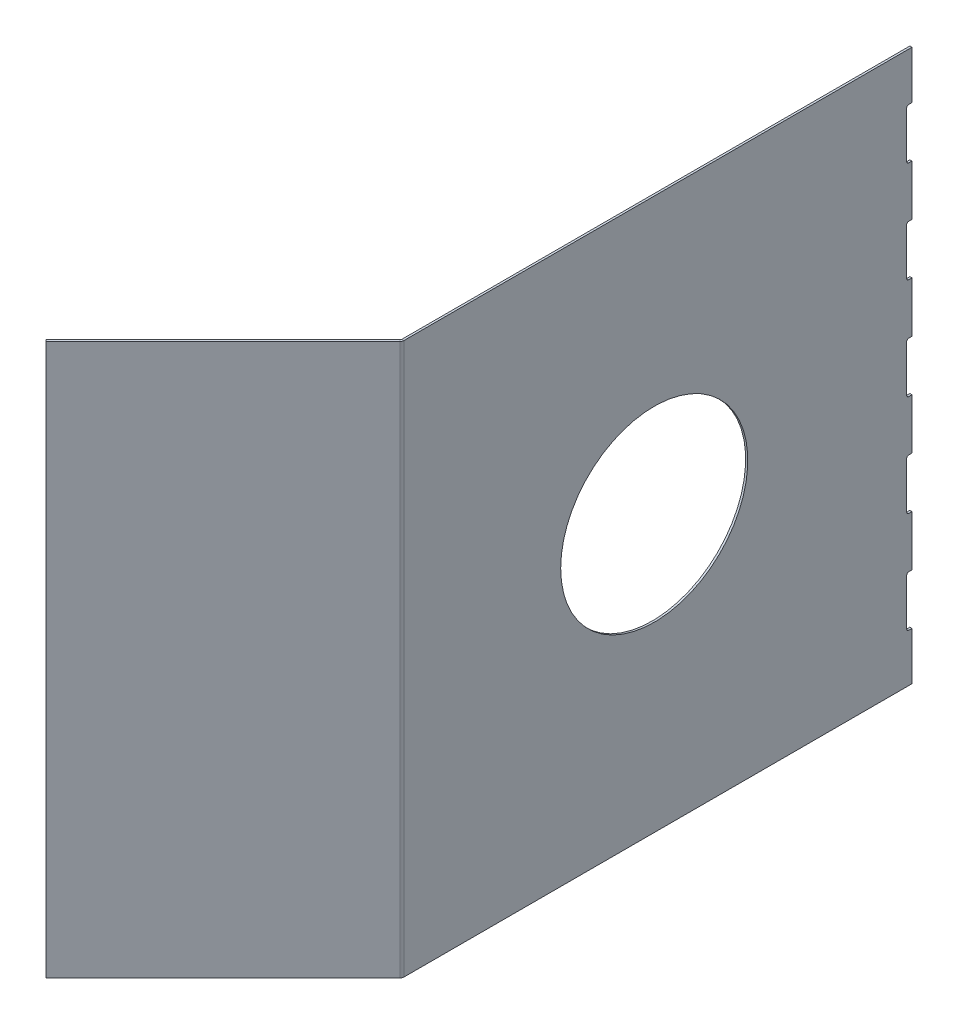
ISO-10303-21;
HEADER;
FILE_DESCRIPTION(('STEP AP214'),'2;1');
FILE_NAME('part.step','',(''),(''),'','','');
FILE_SCHEMA(('AUTOMOTIVE_DESIGN { 1 0 10303 214 1 1 1 1 }'));
ENDSEC;
DATA;
#1=APPLICATION_CONTEXT('core data for automotive mechanical design processes');
#2=APPLICATION_PROTOCOL_DEFINITION('international standard','automotive_design',2000,#1);
#3=PRODUCT_CONTEXT('',#1,'mechanical');
#4=PRODUCT('Part','Part','',(#3));
#5=PRODUCT_RELATED_PRODUCT_CATEGORY('part','',(#4));
#6=PRODUCT_DEFINITION_FORMATION('','',#4);
#7=PRODUCT_DEFINITION_CONTEXT('part definition',#1,'design');
#8=PRODUCT_DEFINITION('design','',#6,#7);
#9=PRODUCT_DEFINITION_SHAPE('','',#8);
#10=(LENGTH_UNIT() NAMED_UNIT(*) SI_UNIT(.MILLI.,.METRE.));
#11=(NAMED_UNIT(*) PLANE_ANGLE_UNIT() SI_UNIT($,.RADIAN.));
#12=(NAMED_UNIT(*) SI_UNIT($,.STERADIAN.) SOLID_ANGLE_UNIT());
#13=UNCERTAINTY_MEASURE_WITH_UNIT(LENGTH_MEASURE(1.E-05),#10,'distance_accuracy_value','');
#14=(GEOMETRIC_REPRESENTATION_CONTEXT(3) GLOBAL_UNCERTAINTY_ASSIGNED_CONTEXT((#13)) GLOBAL_UNIT_ASSIGNED_CONTEXT((#10,
#11,#12)) REPRESENTATION_CONTEXT('',''));
#15=CARTESIAN_POINT('',(0.,0.,0.));
#16=DIRECTION('',(0.,0.,1.));
#17=DIRECTION('',(1.,0.,0.));
#18=AXIS2_PLACEMENT_3D('',#15,#16,#17);
#19=CARTESIAN_POINT('',(-6.35,1660.525,0.));
#20=DIRECTION('',(0.,0.,-1.));
#21=DIRECTION('',(-1.,0.,0.));
#22=AXIS2_PLACEMENT_3D('',#19,#20,#21);
#23=PLANE('',#22);
#24=DIRECTION('',(-1.,0.,0.));
#25=VECTOR('',#24,1.);
#26=CARTESIAN_POINT('',(3.30464822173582E-13,296.8625,0.));
#27=LINE('',#26,#25);
#28=CARTESIAN_POINT('',(3.30464822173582E-13,296.8625,0.));
#29=VERTEX_POINT('',#28);
#30=CARTESIAN_POINT('',(-6.35,296.8625,0.));
#31=VERTEX_POINT('',#30);
#32=EDGE_CURVE('E367',#29,#31,#27,.T.);
#33=ORIENTED_EDGE('',*,*,#32,.T.);
#34=DIRECTION('',(0.,-1.,0.));
#35=VECTOR('',#34,1.);
#36=CARTESIAN_POINT('',(-6.35,1660.525,0.));
#37=LINE('',#36,#35);
#38=CARTESIAN_POINT('',(-6.35,449.2625,0.));
#39=VERTEX_POINT('',#38);
#40=EDGE_CURVE('E564',#39,#31,#37,.T.);
#41=ORIENTED_EDGE('',*,*,#40,.F.);
#42=DIRECTION('',(-1.,0.,0.));
#43=VECTOR('',#42,1.);
#44=CARTESIAN_POINT('',(3.30464822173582E-13,449.2625,0.));
#45=LINE('',#44,#43);
#46=CARTESIAN_POINT('',(3.30464822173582E-13,449.2625,0.));
#47=VERTEX_POINT('',#46);
#48=EDGE_CURVE('E61',#47,#39,#45,.T.);
#49=ORIENTED_EDGE('',*,*,#48,.F.);
#50=DIRECTION('',(0.,-1.,0.));
#51=VECTOR('',#50,1.);
#52=CARTESIAN_POINT('',(0.,1660.525,0.));
#53=LINE('',#52,#51);
#54=EDGE_CURVE('E308',#47,#29,#53,.T.);
#55=ORIENTED_EDGE('',*,*,#54,.T.);
#56=EDGE_LOOP('',(#33,#41,#49,#55));
#57=FACE_BOUND('',#56,.T.);
#58=ADVANCED_FACE('F38',(#57),#23,.T.);
#59=DIRECTION('',(-1.,0.,0.));
#60=VECTOR('',#59,1.);
#61=CARTESIAN_POINT('',(3.30464822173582E-13,601.6625,0.));
#62=LINE('',#61,#60);
#63=CARTESIAN_POINT('',(3.30464822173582E-13,601.6625,0.));
#64=VERTEX_POINT('',#63);
#65=CARTESIAN_POINT('',(-6.35,601.6625,0.));
#66=VERTEX_POINT('',#65);
#67=EDGE_CURVE('E343',#64,#66,#62,.T.);
#68=ORIENTED_EDGE('',*,*,#67,.T.);
#69=CARTESIAN_POINT('',(-6.35,754.0625,0.));
#70=VERTEX_POINT('',#69);
#71=EDGE_CURVE('E568',#70,#66,#37,.T.);
#72=ORIENTED_EDGE('',*,*,#71,.F.);
#73=DIRECTION('',(-1.,0.,0.));
#74=VECTOR('',#73,1.);
#75=CARTESIAN_POINT('',(3.30464822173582E-13,754.0625,0.));
#76=LINE('',#75,#74);
#77=CARTESIAN_POINT('',(3.30464822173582E-13,754.0625,0.));
#78=VERTEX_POINT('',#77);
#79=EDGE_CURVE('E345',#78,#70,#76,.T.);
#80=ORIENTED_EDGE('',*,*,#79,.F.);
#81=EDGE_CURVE('E313',#78,#64,#53,.T.);
#82=ORIENTED_EDGE('',*,*,#81,.T.);
#83=EDGE_LOOP('',(#68,#72,#80,#82));
#84=FACE_BOUND('',#83,.T.);
#85=ADVANCED_FACE('F341',(#84),#23,.T.);
#86=DIRECTION('',(-1.,0.,0.));
#87=VECTOR('',#86,1.);
#88=CARTESIAN_POINT('',(3.30464822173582E-13,906.4625,0.));
#89=LINE('',#88,#87);
#90=CARTESIAN_POINT('',(3.30464822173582E-13,906.4625,0.));
#91=VERTEX_POINT('',#90);
#92=CARTESIAN_POINT('',(-6.35,906.4625,0.));
#93=VERTEX_POINT('',#92);
#94=EDGE_CURVE('E413',#91,#93,#89,.T.);
#95=ORIENTED_EDGE('',*,*,#94,.T.);
#96=CARTESIAN_POINT('',(-6.35,1058.8625,0.));
#97=VERTEX_POINT('',#96);
#98=EDGE_CURVE('E571',#97,#93,#37,.T.);
#99=ORIENTED_EDGE('',*,*,#98,.F.);
#100=DIRECTION('',(-1.,0.,0.));
#101=VECTOR('',#100,1.);
#102=CARTESIAN_POINT('',(3.30464822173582E-13,1058.8625,0.));
#103=LINE('',#102,#101);
#104=CARTESIAN_POINT('',(3.30464822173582E-13,1058.8625,0.));
#105=VERTEX_POINT('',#104);
#106=EDGE_CURVE('E441',#105,#97,#103,.T.);
#107=ORIENTED_EDGE('',*,*,#106,.F.);
#108=EDGE_CURVE('E326',#105,#91,#53,.T.);
#109=ORIENTED_EDGE('',*,*,#108,.T.);
#110=EDGE_LOOP('',(#95,#99,#107,#109));
#111=FACE_BOUND('',#110,.T.);
#112=ADVANCED_FACE('F602',(#111),#23,.T.);
#113=DIRECTION('',(-1.,0.,0.));
#114=VECTOR('',#113,1.);
#115=CARTESIAN_POINT('',(3.30464822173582E-13,1211.2625,0.));
#116=LINE('',#115,#114);
#117=CARTESIAN_POINT('',(3.30464822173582E-13,1211.2625,0.));
#118=VERTEX_POINT('',#117);
#119=CARTESIAN_POINT('',(-6.35,1211.2625,0.));
#120=VERTEX_POINT('',#119);
#121=EDGE_CURVE('E454',#118,#120,#116,.T.);
#122=ORIENTED_EDGE('',*,*,#121,.T.);
#123=CARTESIAN_POINT('',(-6.35,1363.6625,0.));
#124=VERTEX_POINT('',#123);
#125=EDGE_CURVE('E315',#124,#120,#37,.T.);
#126=ORIENTED_EDGE('',*,*,#125,.F.);
#127=DIRECTION('',(-1.,0.,0.));
#128=VECTOR('',#127,1.);
#129=CARTESIAN_POINT('',(3.28730098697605E-13,1363.6625,0.));
#130=LINE('',#129,#128);
#131=CARTESIAN_POINT('',(3.28730098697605E-13,1363.6625,0.));
#132=VERTEX_POINT('',#131);
#133=EDGE_CURVE('E482',#132,#124,#130,.T.);
#134=ORIENTED_EDGE('',*,*,#133,.F.);
#135=EDGE_CURVE('E320',#132,#118,#53,.T.);
#136=ORIENTED_EDGE('',*,*,#135,.T.);
#137=EDGE_LOOP('',(#122,#126,#134,#136));
#138=FACE_BOUND('',#137,.T.);
#139=ADVANCED_FACE('F585',(#138),#23,.T.);
#140=DIRECTION('',(-1.,0.,0.));
#141=VECTOR('',#140,1.);
#142=CARTESIAN_POINT('',(3.28730098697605E-13,1516.0625,0.));
#143=LINE('',#142,#141);
#144=CARTESIAN_POINT('',(3.28730098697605E-13,1516.0625,0.));
#145=VERTEX_POINT('',#144);
#146=CARTESIAN_POINT('',(-6.35,1516.0625,0.));
#147=VERTEX_POINT('',#146);
#148=EDGE_CURVE('E495',#145,#147,#143,.T.);
#149=ORIENTED_EDGE('',*,*,#148,.T.);
#150=CARTESIAN_POINT('',(-6.35,1660.525,0.));
#151=VERTEX_POINT('',#150);
#152=EDGE_CURVE('E309',#151,#147,#37,.T.);
#153=ORIENTED_EDGE('',*,*,#152,.F.);
#154=DIRECTION('',(1.,0.,0.));
#155=VECTOR('',#154,1.);
#156=CARTESIAN_POINT('',(-6.35,1660.525,0.));
#157=LINE('',#156,#155);
#158=CARTESIAN_POINT('',(0.,1660.525,0.));
#159=VERTEX_POINT('',#158);
#160=EDGE_CURVE('E528',#151,#159,#157,.T.);
#161=ORIENTED_EDGE('',*,*,#160,.T.);
#162=EDGE_CURVE('E311',#159,#145,#53,.T.);
#163=ORIENTED_EDGE('',*,*,#162,.T.);
#164=EDGE_LOOP('',(#149,#153,#161,#163));
#165=FACE_BOUND('',#164,.T.);
#166=ADVANCED_FACE('F641',(#165),#23,.T.);
#167=CARTESIAN_POINT('',(-3.71974387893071,1660.525,1538.83224387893));
#168=DIRECTION('',(0.,1.,0.));
#169=DIRECTION('',(0.,0.,1.));
#170=AXIS2_PLACEMENT_3D('',#167,#168,#169);
#171=PLANE('',#170);
#172=DIRECTION('',(-0.707106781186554,0.,-0.707106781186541));
#173=VECTOR('',#172,1.);
#174=CARTESIAN_POINT('',(-3.71974387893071,1660.525,1538.83224387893));
#175=LINE('',#174,#173);
#176=CARTESIAN_POINT('',(-3.71974387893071,1660.525,1538.83224387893));
#177=VERTEX_POINT('',#176);
#178=CARTESIAN_POINT('',(-8.2098719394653,1660.525,1534.3421158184));
#179=VERTEX_POINT('',#178);
#180=EDGE_CURVE('E11',#177,#179,#175,.T.);
#181=ORIENTED_EDGE('',*,*,#180,.F.);
#182=CARTESIAN_POINT('',(-12.6999999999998,1660.525,1529.85198775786));
#183=DIRECTION('',(0.,1.,0.));
#184=DIRECTION('',(0.,0.,1.));
#185=AXIS2_PLACEMENT_3D('',#182,#183,#184);
#186=CIRCLE('',#185,12.7);
#187=CARTESIAN_POINT('',(1.87352833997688E-13,1660.525,1529.85198775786));
#188=VERTEX_POINT('',#187);
#189=EDGE_CURVE('E522',#188,#177,#186,.F.);
#190=ORIENTED_EDGE('',*,*,#189,.F.);
#191=DIRECTION('',(1.,0.,0.));
#192=VECTOR('',#191,1.);
#193=CARTESIAN_POINT('',(-6.3499999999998,1660.525,1529.85198775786));
#194=LINE('',#193,#192);
#195=CARTESIAN_POINT('',(-6.3499999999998,1660.525,1529.85198775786));
#196=VERTEX_POINT('',#195);
#197=EDGE_CURVE('E46',#196,#188,#194,.T.);
#198=ORIENTED_EDGE('',*,*,#197,.F.);
#199=CARTESIAN_POINT('',(-12.6999999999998,1660.525,1529.85198775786));
#200=DIRECTION('',(0.,1.,0.));
#201=DIRECTION('',(1.,0.,0.));
#202=AXIS2_PLACEMENT_3D('',#199,#200,#201);
#203=CIRCLE('',#202,6.35);
#204=EDGE_CURVE('E533',#196,#179,#203,.F.);
#205=ORIENTED_EDGE('',*,*,#204,.T.);
#206=EDGE_LOOP('',(#181,#190,#198,#205));
#207=FACE_BOUND('',#206,.T.);
#208=ADVANCED_FACE('F40',(#207),#171,.T.);
#209=CARTESIAN_POINT('',(-6.3499999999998,1660.525,1529.85198775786));
#210=DIRECTION('',(0.,1.,0.));
#211=DIRECTION('',(0.,0.,1.));
#212=AXIS2_PLACEMENT_3D('',#209,#210,#211);
#213=PLANE('',#212);
#214=DIRECTION('',(-0.707106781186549,0.,0.707106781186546));
#215=VECTOR('',#214,1.);
#216=CARTESIAN_POINT('',(1.87997060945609E-13,1660.525,1535.1125));
#217=LINE('',#216,#215);
#218=CARTESIAN_POINT('',(-536.570303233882,1660.525,2071.68280323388));
#219=VERTEX_POINT('',#218);
#220=EDGE_CURVE('E519',#177,#219,#217,.T.);
#221=ORIENTED_EDGE('',*,*,#220,.F.);
#222=ORIENTED_EDGE('',*,*,#180,.T.);
#223=DIRECTION('',(-0.707106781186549,0.,0.707106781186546));
#224=VECTOR('',#223,1.);
#225=CARTESIAN_POINT('',(-4.49012806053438,1660.525,1530.62237193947));
#226=LINE('',#225,#224);
#227=CARTESIAN_POINT('',(-541.060431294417,1660.525,2067.19267517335));
#228=VERTEX_POINT('',#227);
#229=EDGE_CURVE('E513',#179,#228,#226,.T.);
#230=ORIENTED_EDGE('',*,*,#229,.T.);
#231=DIRECTION('',(-0.707106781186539,0.,-0.707106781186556));
#232=VECTOR('',#231,1.);
#233=CARTESIAN_POINT('',(-536.570303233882,1660.525,2071.68280323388));
#234=LINE('',#233,#232);
#235=EDGE_CURVE('E515',#219,#228,#234,.T.);
#236=ORIENTED_EDGE('',*,*,#235,.F.);
#237=EDGE_LOOP('',(#221,#222,#230,#236));
#238=FACE_BOUND('',#237,.T.);
#239=ADVANCED_FACE('F654',(#238),#213,.T.);
#240=CARTESIAN_POINT('',(1.87352833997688E-13,0.,1529.85198775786));
#241=DIRECTION('',(0.,-1.,0.));
#242=DIRECTION('',(0.,0.,-1.));
#243=AXIS2_PLACEMENT_3D('',#240,#241,#242);
#244=PLANE('',#243);
#245=DIRECTION('',(-1.,0.,0.));
#246=VECTOR('',#245,1.);
#247=CARTESIAN_POINT('',(1.87352833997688E-13,0.,1529.85198775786));
#248=LINE('',#247,#246);
#249=CARTESIAN_POINT('',(1.87352833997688E-13,0.,1529.85198775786));
#250=VERTEX_POINT('',#249);
#251=CARTESIAN_POINT('',(-6.3499999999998,0.,1529.85198775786));
#252=VERTEX_POINT('',#251);
#253=EDGE_CURVE('E719',#250,#252,#248,.T.);
#254=ORIENTED_EDGE('',*,*,#253,.F.);
#255=CARTESIAN_POINT('',(-12.6999999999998,0.,1529.85198775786));
#256=DIRECTION('',(0.,1.,0.));
#257=DIRECTION('',(0.,0.,1.));
#258=AXIS2_PLACEMENT_3D('',#255,#256,#257);
#259=CIRCLE('',#258,12.7);
#260=CARTESIAN_POINT('',(-3.71974387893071,0.,1538.83224387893));
#261=VERTEX_POINT('',#260);
#262=EDGE_CURVE('E545',#250,#261,#259,.F.);
#263=ORIENTED_EDGE('',*,*,#262,.T.);
#264=DIRECTION('',(0.707106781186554,0.,0.707106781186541));
#265=VECTOR('',#264,1.);
#266=CARTESIAN_POINT('',(-8.2098719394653,0.,1534.3421158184));
#267=LINE('',#266,#265);
#268=CARTESIAN_POINT('',(-8.2098719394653,0.,1534.3421158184));
#269=VERTEX_POINT('',#268);
#270=EDGE_CURVE('E709',#269,#261,#267,.T.);
#271=ORIENTED_EDGE('',*,*,#270,.F.);
#272=CARTESIAN_POINT('',(-12.6999999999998,0.,1529.85198775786));
#273=DIRECTION('',(0.,1.,0.));
#274=DIRECTION('',(1.,0.,0.));
#275=AXIS2_PLACEMENT_3D('',#272,#273,#274);
#276=CIRCLE('',#275,6.35);
#277=EDGE_CURVE('E516',#252,#269,#276,.F.);
#278=ORIENTED_EDGE('',*,*,#277,.F.);
#279=EDGE_LOOP('',(#254,#263,#271,#278));
#280=FACE_BOUND('',#279,.T.);
#281=ADVANCED_FACE('F726',(#280),#244,.T.);
#282=CARTESIAN_POINT('',(-8.2098719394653,0.,1534.3421158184));
#283=DIRECTION('',(0.,-1.,0.));
#284=DIRECTION('',(0.,0.,-1.));
#285=AXIS2_PLACEMENT_3D('',#282,#283,#284);
#286=PLANE('',#285);
#287=DIRECTION('',(0.,0.,1.));
#288=VECTOR('',#287,1.);
#289=CARTESIAN_POINT('',(0.,0.,0.));
#290=LINE('',#289,#288);
#291=CARTESIAN_POINT('',(0.,0.,0.));
#292=VERTEX_POINT('',#291);
#293=EDGE_CURVE('E306',#292,#250,#290,.T.);
#294=ORIENTED_EDGE('',*,*,#293,.T.);
#295=ORIENTED_EDGE('',*,*,#253,.T.);
#296=DIRECTION('',(0.,0.,1.));
#297=VECTOR('',#296,1.);
#298=CARTESIAN_POINT('',(-6.35,0.,0.));
#299=LINE('',#298,#297);
#300=CARTESIAN_POINT('',(-6.35,0.,0.));
#301=VERTEX_POINT('',#300);
#302=EDGE_CURVE('E551',#301,#252,#299,.T.);
#303=ORIENTED_EDGE('',*,*,#302,.F.);
#304=DIRECTION('',(1.,0.,0.));
#305=VECTOR('',#304,1.);
#306=CARTESIAN_POINT('',(-6.35,0.,0.));
#307=LINE('',#306,#305);
#308=EDGE_CURVE('E549',#301,#292,#307,.T.);
#309=ORIENTED_EDGE('',*,*,#308,.T.);
#310=EDGE_LOOP('',(#294,#295,#303,#309));
#311=FACE_BOUND('',#310,.T.);
#312=ADVANCED_FACE('F725',(#311),#286,.T.);
#313=CARTESIAN_POINT('',(-4.49012806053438,1660.525,1530.62237193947));
#314=DIRECTION('',(0.707106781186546,0.,0.707106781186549));
#315=DIRECTION('',(0.707106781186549,0.,-0.707106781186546));
#316=AXIS2_PLACEMENT_3D('',#313,#314,#315);
#317=PLANE('',#316);
#318=DIRECTION('',(-0.707106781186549,0.,0.707106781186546));
#319=VECTOR('',#318,1.);
#320=CARTESIAN_POINT('',(-4.49012806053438,0.,1530.62237193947));
#321=LINE('',#320,#319);
#322=CARTESIAN_POINT('',(-541.060431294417,0.,2067.19267517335));
#323=VERTEX_POINT('',#322);
#324=EDGE_CURVE('E510',#269,#323,#321,.T.);
#325=ORIENTED_EDGE('',*,*,#324,.T.);
#326=DIRECTION('',(0.,-1.,0.));
#327=VECTOR('',#326,1.);
#328=CARTESIAN_POINT('',(-541.060431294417,1660.525,2067.19267517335));
#329=LINE('',#328,#327);
#330=EDGE_CURVE('E717',#228,#323,#329,.T.);
#331=ORIENTED_EDGE('',*,*,#330,.F.);
#332=ORIENTED_EDGE('',*,*,#229,.F.);
#333=DIRECTION('',(0.,-1.,0.));
#334=VECTOR('',#333,1.);
#335=CARTESIAN_POINT('',(-8.2098719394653,1660.525,1534.3421158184));
#336=LINE('',#335,#334);
#337=EDGE_CURVE('E536',#179,#269,#336,.T.);
#338=ORIENTED_EDGE('',*,*,#337,.T.);
#339=EDGE_LOOP('',(#325,#331,#332,#338));
#340=FACE_BOUND('',#339,.T.);
#341=ADVANCED_FACE('F707',(#340),#317,.F.);
#342=CARTESIAN_POINT('',(-536.570303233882,1660.525,2071.68280323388));
#343=DIRECTION('',(-0.707106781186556,0.,0.707106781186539));
#344=DIRECTION('',(0.707106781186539,0.,0.707106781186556));
#345=AXIS2_PLACEMENT_3D('',#342,#343,#344);
#346=PLANE('',#345);
#347=DIRECTION('',(-0.707106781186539,0.,-0.707106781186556));
#348=VECTOR('',#347,1.);
#349=CARTESIAN_POINT('',(-536.570303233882,0.,2071.68280323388));
#350=LINE('',#349,#348);
#351=CARTESIAN_POINT('',(-536.570303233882,0.,2071.68280323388));
#352=VERTEX_POINT('',#351);
#353=EDGE_CURVE('E539',#352,#323,#350,.T.);
#354=ORIENTED_EDGE('',*,*,#353,.F.);
#355=DIRECTION('',(0.,-1.,0.));
#356=VECTOR('',#355,1.);
#357=CARTESIAN_POINT('',(-536.570303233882,1660.525,2071.68280323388));
#358=LINE('',#357,#356);
#359=EDGE_CURVE('E715',#219,#352,#358,.T.);
#360=ORIENTED_EDGE('',*,*,#359,.F.);
#361=ORIENTED_EDGE('',*,*,#235,.T.);
#362=ORIENTED_EDGE('',*,*,#330,.T.);
#363=EDGE_LOOP('',(#354,#360,#361,#362));
#364=FACE_BOUND('',#363,.T.);
#365=ADVANCED_FACE('F714',(#364),#346,.T.);
#366=CARTESIAN_POINT('',(1.87997060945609E-13,1660.525,1535.1125));
#367=DIRECTION('',(0.707106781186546,0.,0.707106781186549));
#368=DIRECTION('',(0.707106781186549,0.,-0.707106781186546));
#369=AXIS2_PLACEMENT_3D('',#366,#367,#368);
#370=PLANE('',#369);
#371=DIRECTION('',(-0.707106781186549,0.,0.707106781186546));
#372=VECTOR('',#371,1.);
#373=CARTESIAN_POINT('',(1.87997060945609E-13,0.,1535.1125));
#374=LINE('',#373,#372);
#375=EDGE_CURVE('E542',#261,#352,#374,.T.);
#376=ORIENTED_EDGE('',*,*,#375,.F.);
#377=DIRECTION('',(0.,-1.,0.));
#378=VECTOR('',#377,1.);
#379=CARTESIAN_POINT('',(-3.71974387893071,1660.525,1538.83224387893));
#380=LINE('',#379,#378);
#381=EDGE_CURVE('E324',#177,#261,#380,.T.);
#382=ORIENTED_EDGE('',*,*,#381,.F.);
#383=ORIENTED_EDGE('',*,*,#220,.T.);
#384=ORIENTED_EDGE('',*,*,#359,.T.);
#385=EDGE_LOOP('',(#376,#382,#383,#384));
#386=FACE_BOUND('',#385,.T.);
#387=ADVANCED_FACE('F732',(#386),#370,.T.);
#388=CARTESIAN_POINT('',(-12.6999999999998,1660.525,1529.85198775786));
#389=DIRECTION('',(0.,-1.,0.));
#390=DIRECTION('',(0.,0.,-1.));
#391=AXIS2_PLACEMENT_3D('',#388,#389,#390);
#392=CYLINDRICAL_SURFACE('',#391,12.7);
#393=ORIENTED_EDGE('',*,*,#262,.F.);
#394=DIRECTION('',(0.,-1.,0.));
#395=VECTOR('',#394,1.);
#396=CARTESIAN_POINT('',(1.87352833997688E-13,1660.525,1529.85198775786));
#397=LINE('',#396,#395);
#398=EDGE_CURVE('E319',#188,#250,#397,.T.);
#399=ORIENTED_EDGE('',*,*,#398,.F.);
#400=ORIENTED_EDGE('',*,*,#189,.T.);
#401=ORIENTED_EDGE('',*,*,#381,.T.);
#402=EDGE_LOOP('',(#393,#399,#400,#401));
#403=FACE_BOUND('',#402,.T.);
#404=ADVANCED_FACE('F648',(#403),#392,.T.);
#405=CARTESIAN_POINT('',(0.,1660.525,0.));
#406=DIRECTION('',(1.,0.,0.));
#407=DIRECTION('',(0.,0.,-1.));
#408=AXIS2_PLACEMENT_3D('',#405,#406,#407);
#409=PLANE('',#408);
#410=DIRECTION('',(0.,0.,-1.));
#411=VECTOR('',#410,1.);
#412=CARTESIAN_POINT('',(3.30464822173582E-13,296.8625,0.));
#413=LINE('',#412,#411);
#414=CARTESIAN_POINT('',(3.3133218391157E-13,296.8625,9.52500000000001));
#415=VERTEX_POINT('',#414);
#416=EDGE_CURVE('E299',#415,#29,#413,.T.);
#417=ORIENTED_EDGE('',*,*,#416,.T.);
#418=ORIENTED_EDGE('',*,*,#54,.F.);
#419=DIRECTION('',(0.,0.,1.));
#420=VECTOR('',#419,1.);
#421=CARTESIAN_POINT('',(3.30464822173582E-13,449.2625,0.));
#422=LINE('',#421,#420);
#423=CARTESIAN_POINT('',(3.3133218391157E-13,449.2625,9.52500000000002));
#424=VERTEX_POINT('',#423);
#425=EDGE_CURVE('E378',#47,#424,#422,.T.);
#426=ORIENTED_EDGE('',*,*,#425,.T.);
#427=CARTESIAN_POINT('',(3.3133218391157E-13,455.6125,9.52500000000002));
#428=DIRECTION('',(-1.,0.,0.));
#429=DIRECTION('',(0.,0.,1.));
#430=AXIS2_PLACEMENT_3D('',#427,#428,#429);
#431=CIRCLE('',#430,6.35000000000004);
#432=CARTESIAN_POINT('',(3.32199545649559E-13,455.6125,15.875));
#433=VERTEX_POINT('',#432);
#434=EDGE_CURVE('E1205',#424,#433,#431,.T.);
#435=ORIENTED_EDGE('',*,*,#434,.T.);
#436=DIRECTION('',(0.,1.,0.));
#437=VECTOR('',#436,1.);
#438=CARTESIAN_POINT('',(3.32199545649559E-13,595.3125,15.875));
#439=LINE('',#438,#437);
#440=CARTESIAN_POINT('',(3.32199545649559E-13,595.3125,15.875));
#441=VERTEX_POINT('',#440);
#442=EDGE_CURVE('E360',#433,#441,#439,.T.);
#443=ORIENTED_EDGE('',*,*,#442,.T.);
#444=CARTESIAN_POINT('',(3.3133218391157E-13,595.3125,9.52500000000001));
#445=DIRECTION('',(-1.,0.,0.));
#446=DIRECTION('',(0.,0.,1.));
#447=AXIS2_PLACEMENT_3D('',#444,#445,#446);
#448=CIRCLE('',#447,6.35000000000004);
#449=CARTESIAN_POINT('',(3.3133218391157E-13,601.6625,9.52500000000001));
#450=VERTEX_POINT('',#449);
#451=EDGE_CURVE('E355',#441,#450,#448,.T.);
#452=ORIENTED_EDGE('',*,*,#451,.T.);
#453=DIRECTION('',(0.,0.,-1.));
#454=VECTOR('',#453,1.);
#455=CARTESIAN_POINT('',(3.30464822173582E-13,601.6625,0.));
#456=LINE('',#455,#454);
#457=EDGE_CURVE('E352',#450,#64,#456,.T.);
#458=ORIENTED_EDGE('',*,*,#457,.T.);
#459=ORIENTED_EDGE('',*,*,#81,.F.);
#460=DIRECTION('',(0.,0.,1.));
#461=VECTOR('',#460,1.);
#462=CARTESIAN_POINT('',(3.30464822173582E-13,754.0625,0.));
#463=LINE('',#462,#461);
#464=CARTESIAN_POINT('',(3.3133218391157E-13,754.0625,9.52500000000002));
#465=VERTEX_POINT('',#464);
#466=EDGE_CURVE('E349',#78,#465,#463,.T.);
#467=ORIENTED_EDGE('',*,*,#466,.T.);
#468=CARTESIAN_POINT('',(3.3133218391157E-13,760.4125,9.52500000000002));
#469=DIRECTION('',(-1.,0.,0.));
#470=DIRECTION('',(0.,0.,1.));
#471=AXIS2_PLACEMENT_3D('',#468,#469,#470);
#472=CIRCLE('',#471,6.35000000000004);
#473=CARTESIAN_POINT('',(3.32199545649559E-13,760.4125,15.875));
#474=VERTEX_POINT('',#473);
#475=EDGE_CURVE('E389',#465,#474,#472,.T.);
#476=ORIENTED_EDGE('',*,*,#475,.T.);
#477=DIRECTION('',(0.,1.,0.));
#478=VECTOR('',#477,1.);
#479=CARTESIAN_POINT('',(3.32199545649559E-13,900.1125,15.875));
#480=LINE('',#479,#478);
#481=CARTESIAN_POINT('',(3.32199545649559E-13,900.1125,15.875));
#482=VERTEX_POINT('',#481);
#483=EDGE_CURVE('E392',#474,#482,#480,.T.);
#484=ORIENTED_EDGE('',*,*,#483,.T.);
#485=CARTESIAN_POINT('',(3.3133218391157E-13,900.1125,9.52500000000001));
#486=DIRECTION('',(-1.,0.,0.));
#487=DIRECTION('',(0.,0.,1.));
#488=AXIS2_PLACEMENT_3D('',#485,#486,#487);
#489=CIRCLE('',#488,6.35000000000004);
#490=CARTESIAN_POINT('',(3.3133218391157E-13,906.4625,9.52500000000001));
#491=VERTEX_POINT('',#490);
#492=EDGE_CURVE('E395',#482,#491,#489,.T.);
#493=ORIENTED_EDGE('',*,*,#492,.T.);
#494=DIRECTION('',(0.,0.,-1.));
#495=VECTOR('',#494,1.);
#496=CARTESIAN_POINT('',(3.30464822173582E-13,906.4625,0.));
#497=LINE('',#496,#495);
#498=EDGE_CURVE('E398',#491,#91,#497,.T.);
#499=ORIENTED_EDGE('',*,*,#498,.T.);
#500=ORIENTED_EDGE('',*,*,#108,.F.);
#501=DIRECTION('',(0.,0.,1.));
#502=VECTOR('',#501,1.);
#503=CARTESIAN_POINT('',(3.30464822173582E-13,1058.8625,0.));
#504=LINE('',#503,#502);
#505=CARTESIAN_POINT('',(3.3133218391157E-13,1058.8625,9.52500000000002));
#506=VERTEX_POINT('',#505);
#507=EDGE_CURVE('E425',#105,#506,#504,.T.);
#508=ORIENTED_EDGE('',*,*,#507,.T.);
#509=CARTESIAN_POINT('',(3.3133218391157E-13,1065.2125,9.52500000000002));
#510=DIRECTION('',(-1.,0.,0.));
#511=DIRECTION('',(0.,0.,1.));
#512=AXIS2_PLACEMENT_3D('',#509,#510,#511);
#513=CIRCLE('',#512,6.35000000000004);
#514=CARTESIAN_POINT('',(3.32199545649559E-13,1065.2125,15.875));
#515=VERTEX_POINT('',#514);
#516=EDGE_CURVE('E428',#506,#515,#513,.T.);
#517=ORIENTED_EDGE('',*,*,#516,.T.);
#518=DIRECTION('',(0.,1.,0.));
#519=VECTOR('',#518,1.);
#520=CARTESIAN_POINT('',(3.32199545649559E-13,1204.9125,15.875));
#521=LINE('',#520,#519);
#522=CARTESIAN_POINT('',(3.32199545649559E-13,1204.9125,15.875));
#523=VERTEX_POINT('',#522);
#524=EDGE_CURVE('E432',#515,#523,#521,.T.);
#525=ORIENTED_EDGE('',*,*,#524,.T.);
#526=CARTESIAN_POINT('',(3.3133218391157E-13,1204.9125,9.52500000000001));
#527=DIRECTION('',(-1.,0.,0.));
#528=DIRECTION('',(0.,0.,1.));
#529=AXIS2_PLACEMENT_3D('',#526,#527,#528);
#530=CIRCLE('',#529,6.35000000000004);
#531=CARTESIAN_POINT('',(3.3133218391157E-13,1211.2625,9.52500000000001));
#532=VERTEX_POINT('',#531);
#533=EDGE_CURVE('E435',#523,#532,#530,.T.);
#534=ORIENTED_EDGE('',*,*,#533,.T.);
#535=DIRECTION('',(0.,0.,-1.));
#536=VECTOR('',#535,1.);
#537=CARTESIAN_POINT('',(3.30464822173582E-13,1211.2625,0.));
#538=LINE('',#537,#536);
#539=EDGE_CURVE('E438',#532,#118,#538,.T.);
#540=ORIENTED_EDGE('',*,*,#539,.T.);
#541=ORIENTED_EDGE('',*,*,#135,.F.);
#542=DIRECTION('',(0.,0.,1.));
#543=VECTOR('',#542,1.);
#544=CARTESIAN_POINT('',(3.28730098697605E-13,1363.6625,0.));
#545=LINE('',#544,#543);
#546=CARTESIAN_POINT('',(3.29597460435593E-13,1363.6625,9.52500000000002));
#547=VERTEX_POINT('',#546);
#548=EDGE_CURVE('E466',#132,#547,#545,.T.);
#549=ORIENTED_EDGE('',*,*,#548,.T.);
#550=CARTESIAN_POINT('',(3.29597460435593E-13,1370.0125,9.52500000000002));
#551=DIRECTION('',(-1.,0.,0.));
#552=DIRECTION('',(0.,0.,1.));
#553=AXIS2_PLACEMENT_3D('',#550,#551,#552);
#554=CIRCLE('',#553,6.35000000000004);
#555=CARTESIAN_POINT('',(3.30464822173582E-13,1370.0125,15.875));
#556=VERTEX_POINT('',#555);
#557=EDGE_CURVE('E469',#547,#556,#554,.T.);
#558=ORIENTED_EDGE('',*,*,#557,.T.);
#559=DIRECTION('',(0.,1.,0.));
#560=VECTOR('',#559,1.);
#561=CARTESIAN_POINT('',(3.30464822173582E-13,1509.7125,15.875));
#562=LINE('',#561,#560);
#563=CARTESIAN_POINT('',(3.30464822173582E-13,1509.7125,15.875));
#564=VERTEX_POINT('',#563);
#565=EDGE_CURVE('E473',#556,#564,#562,.T.);
#566=ORIENTED_EDGE('',*,*,#565,.T.);
#567=CARTESIAN_POINT('',(3.29597460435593E-13,1509.7125,9.52500000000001));
#568=DIRECTION('',(-1.,0.,0.));
#569=DIRECTION('',(0.,0.,1.));
#570=AXIS2_PLACEMENT_3D('',#567,#568,#569);
#571=CIRCLE('',#570,6.35000000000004);
#572=CARTESIAN_POINT('',(3.29597460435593E-13,1516.0625,9.52500000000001));
#573=VERTEX_POINT('',#572);
#574=EDGE_CURVE('E476',#564,#573,#571,.T.);
#575=ORIENTED_EDGE('',*,*,#574,.T.);
#576=DIRECTION('',(0.,0.,-1.));
#577=VECTOR('',#576,1.);
#578=CARTESIAN_POINT('',(3.28730098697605E-13,1516.0625,0.));
#579=LINE('',#578,#577);
#580=EDGE_CURVE('E479',#573,#145,#579,.T.);
#581=ORIENTED_EDGE('',*,*,#580,.T.);
#582=ORIENTED_EDGE('',*,*,#162,.F.);
#583=DIRECTION('',(0.,0.,1.));
#584=VECTOR('',#583,1.);
#585=CARTESIAN_POINT('',(0.,1660.525,0.));
#586=LINE('',#585,#584);
#587=EDGE_CURVE('E525',#159,#188,#586,.T.);
#588=ORIENTED_EDGE('',*,*,#587,.T.);
#589=ORIENTED_EDGE('',*,*,#398,.T.);
#590=ORIENTED_EDGE('',*,*,#293,.F.);
#591=CARTESIAN_POINT('',(3.30464822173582E-13,144.4625,0.));
#592=VERTEX_POINT('',#591);
#593=EDGE_CURVE('E296',#592,#292,#53,.T.);
#594=ORIENTED_EDGE('',*,*,#593,.F.);
#595=DIRECTION('',(0.,0.,1.));
#596=VECTOR('',#595,1.);
#597=CARTESIAN_POINT('',(3.30464822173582E-13,144.4625,0.));
#598=LINE('',#597,#596);
#599=CARTESIAN_POINT('',(3.3133218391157E-13,144.4625,9.52500000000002));
#600=VERTEX_POINT('',#599);
#601=EDGE_CURVE('E282',#592,#600,#598,.T.);
#602=ORIENTED_EDGE('',*,*,#601,.T.);
#603=CARTESIAN_POINT('',(3.3133218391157E-13,150.8125,9.52500000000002));
#604=DIRECTION('',(-1.,0.,0.));
#605=DIRECTION('',(0.,0.,1.));
#606=AXIS2_PLACEMENT_3D('',#603,#604,#605);
#607=CIRCLE('',#606,6.35000000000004);
#608=CARTESIAN_POINT('',(3.32199545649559E-13,150.8125,15.875));
#609=VERTEX_POINT('',#608);
#610=EDGE_CURVE('E289',#600,#609,#607,.T.);
#611=ORIENTED_EDGE('',*,*,#610,.T.);
#612=DIRECTION('',(0.,1.,0.));
#613=VECTOR('',#612,1.);
#614=CARTESIAN_POINT('',(3.32199545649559E-13,290.5125,15.875));
#615=LINE('',#614,#613);
#616=CARTESIAN_POINT('',(3.32199545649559E-13,290.5125,15.875));
#617=VERTEX_POINT('',#616);
#618=EDGE_CURVE('E1219',#609,#617,#615,.T.);
#619=ORIENTED_EDGE('',*,*,#618,.T.);
#620=CARTESIAN_POINT('',(3.3133218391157E-13,290.5125,9.52500000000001));
#621=DIRECTION('',(-1.,0.,0.));
#622=DIRECTION('',(0.,0.,1.));
#623=AXIS2_PLACEMENT_3D('',#620,#621,#622);
#624=CIRCLE('',#623,6.35000000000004);
#625=EDGE_CURVE('E1217',#617,#415,#624,.T.);
#626=ORIENTED_EDGE('',*,*,#625,.T.);
#627=EDGE_LOOP('',(#417,#418,#426,#435,#443,#452,#458,#459,#467,#476,#484,#493,#499,#500,#508,
#517,#525,#534,#540,#541,#549,#558,#566,#575,#581,#582,#588,#589,#590,#594,#602,#611,#619,#626));
#628=FACE_BOUND('',#627,.T.);
#629=CARTESIAN_POINT('',(2.94035629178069E-13,830.2625,776.2875));
#630=DIRECTION('',(-1.,0.,0.));
#631=DIRECTION('',(0.,0.,1.));
#632=AXIS2_PLACEMENT_3D('',#629,#630,#631);
#633=CIRCLE('',#632,281.78125);
#634=CARTESIAN_POINT('',(3.28543879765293E-13,830.2625,1058.06875));
#635=VERTEX_POINT('',#634);
#636=EDGE_CURVE('E507',#635,#635,#633,.T.);
#637=ORIENTED_EDGE('',*,*,#636,.T.);
#638=EDGE_LOOP('',(#637));
#639=FACE_BOUND('',#638,.T.);
#640=ADVANCED_FACE('F302',(#628,#639),#409,.T.);
#641=DIRECTION('',(-1.,0.,0.));
#642=VECTOR('',#641,1.);
#643=CARTESIAN_POINT('',(3.30464822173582E-13,144.4625,0.));
#644=LINE('',#643,#642);
#645=CARTESIAN_POINT('',(-6.35,144.4625,0.));
#646=VERTEX_POINT('',#645);
#647=EDGE_CURVE('E53',#592,#646,#644,.T.);
#648=ORIENTED_EDGE('',*,*,#647,.F.);
#649=ORIENTED_EDGE('',*,*,#593,.T.);
#650=ORIENTED_EDGE('',*,*,#308,.F.);
#651=EDGE_CURVE('E298',#646,#301,#37,.T.);
#652=ORIENTED_EDGE('',*,*,#651,.F.);
#653=EDGE_LOOP('',(#648,#649,#650,#652));
#654=FACE_BOUND('',#653,.T.);
#655=ADVANCED_FACE('F294',(#654),#23,.T.);
#656=CARTESIAN_POINT('',(-6.35,1660.525,0.));
#657=DIRECTION('',(1.,0.,0.));
#658=DIRECTION('',(0.,0.,-1.));
#659=AXIS2_PLACEMENT_3D('',#656,#657,#658);
#660=PLANE('',#659);
#661=CARTESIAN_POINT('',(-6.3499999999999,830.2625,776.2875));
#662=DIRECTION('',(-1.,0.,0.));
#663=DIRECTION('',(0.,0.,1.));
#664=AXIS2_PLACEMENT_3D('',#661,#662,#663);
#665=CIRCLE('',#664,281.78125);
#666=CARTESIAN_POINT('',(-6.34999999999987,830.2625,1058.06875));
#667=VERTEX_POINT('',#666);
#668=EDGE_CURVE('E497',#667,#667,#665,.T.);
#669=ORIENTED_EDGE('',*,*,#668,.F.);
#670=EDGE_LOOP('',(#669));
#671=FACE_BOUND('',#670,.T.);
#672=ORIENTED_EDGE('',*,*,#40,.T.);
#673=DIRECTION('',(0.,0.,-1.));
#674=VECTOR('',#673,1.);
#675=CARTESIAN_POINT('',(-6.35,296.8625,0.));
#676=LINE('',#675,#674);
#677=CARTESIAN_POINT('',(-6.35,296.8625,9.52500000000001));
#678=VERTEX_POINT('',#677);
#679=EDGE_CURVE('E290',#678,#31,#676,.T.);
#680=ORIENTED_EDGE('',*,*,#679,.F.);
#681=CARTESIAN_POINT('',(-6.35,290.5125,9.52500000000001));
#682=DIRECTION('',(-1.,0.,0.));
#683=DIRECTION('',(0.,0.,1.));
#684=AXIS2_PLACEMENT_3D('',#681,#682,#683);
#685=CIRCLE('',#684,6.35000000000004);
#686=CARTESIAN_POINT('',(-6.35,290.5125,15.875));
#687=VERTEX_POINT('',#686);
#688=EDGE_CURVE('E1190',#687,#678,#685,.T.);
#689=ORIENTED_EDGE('',*,*,#688,.F.);
#690=DIRECTION('',(0.,1.,0.));
#691=VECTOR('',#690,1.);
#692=CARTESIAN_POINT('',(-6.35,290.5125,15.875));
#693=LINE('',#692,#691);
#694=CARTESIAN_POINT('',(-6.35,150.8125,15.875));
#695=VERTEX_POINT('',#694);
#696=EDGE_CURVE('E1184',#695,#687,#693,.T.);
#697=ORIENTED_EDGE('',*,*,#696,.F.);
#698=CARTESIAN_POINT('',(-6.35,150.8125,9.52500000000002));
#699=DIRECTION('',(-1.,0.,0.));
#700=DIRECTION('',(0.,0.,1.));
#701=AXIS2_PLACEMENT_3D('',#698,#699,#700);
#702=CIRCLE('',#701,6.35000000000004);
#703=CARTESIAN_POINT('',(-6.35,144.4625,9.52500000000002));
#704=VERTEX_POINT('',#703);
#705=EDGE_CURVE('E1180',#704,#695,#702,.T.);
#706=ORIENTED_EDGE('',*,*,#705,.F.);
#707=DIRECTION('',(0.,0.,1.));
#708=VECTOR('',#707,1.);
#709=CARTESIAN_POINT('',(-6.35,144.4625,0.));
#710=LINE('',#709,#708);
#711=EDGE_CURVE('E1185',#646,#704,#710,.T.);
#712=ORIENTED_EDGE('',*,*,#711,.F.);
#713=ORIENTED_EDGE('',*,*,#651,.T.);
#714=ORIENTED_EDGE('',*,*,#302,.T.);
#715=DIRECTION('',(0.,-1.,0.));
#716=VECTOR('',#715,1.);
#717=CARTESIAN_POINT('',(-6.3499999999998,1660.525,1529.85198775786));
#718=LINE('',#717,#716);
#719=EDGE_CURVE('E558',#196,#252,#718,.T.);
#720=ORIENTED_EDGE('',*,*,#719,.F.);
#721=DIRECTION('',(0.,0.,1.));
#722=VECTOR('',#721,1.);
#723=CARTESIAN_POINT('',(-6.35,1660.525,0.));
#724=LINE('',#723,#722);
#725=EDGE_CURVE('E530',#151,#196,#724,.T.);
#726=ORIENTED_EDGE('',*,*,#725,.F.);
#727=ORIENTED_EDGE('',*,*,#152,.T.);
#728=DIRECTION('',(0.,0.,-1.));
#729=VECTOR('',#728,1.);
#730=CARTESIAN_POINT('',(-6.35,1516.0625,0.));
#731=LINE('',#730,#729);
#732=CARTESIAN_POINT('',(-6.35,1516.0625,9.52500000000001));
#733=VERTEX_POINT('',#732);
#734=EDGE_CURVE('E470',#733,#147,#731,.T.);
#735=ORIENTED_EDGE('',*,*,#734,.F.);
#736=CARTESIAN_POINT('',(-6.35,1509.7125,9.52500000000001));
#737=DIRECTION('',(-1.,0.,0.));
#738=DIRECTION('',(0.,0.,1.));
#739=AXIS2_PLACEMENT_3D('',#736,#737,#738);
#740=CIRCLE('',#739,6.35000000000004);
#741=CARTESIAN_POINT('',(-6.35,1509.7125,15.875));
#742=VERTEX_POINT('',#741);
#743=EDGE_CURVE('E491',#742,#733,#740,.T.);
#744=ORIENTED_EDGE('',*,*,#743,.F.);
#745=DIRECTION('',(0.,1.,0.));
#746=VECTOR('',#745,1.);
#747=CARTESIAN_POINT('',(-6.35,1509.7125,15.875));
#748=LINE('',#747,#746);
#749=CARTESIAN_POINT('',(-6.35,1370.0125,15.875));
#750=VERTEX_POINT('',#749);
#751=EDGE_CURVE('E488',#750,#742,#748,.T.);
#752=ORIENTED_EDGE('',*,*,#751,.F.);
#753=CARTESIAN_POINT('',(-6.35,1370.0125,9.52500000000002));
#754=DIRECTION('',(-1.,0.,0.));
#755=DIRECTION('',(0.,0.,1.));
#756=AXIS2_PLACEMENT_3D('',#753,#754,#755);
#757=CIRCLE('',#756,6.35000000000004);
#758=CARTESIAN_POINT('',(-6.35,1363.6625,9.52500000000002));
#759=VERTEX_POINT('',#758);
#760=EDGE_CURVE('E485',#759,#750,#757,.T.);
#761=ORIENTED_EDGE('',*,*,#760,.F.);
#762=DIRECTION('',(0.,0.,1.));
#763=VECTOR('',#762,1.);
#764=CARTESIAN_POINT('',(-6.35,1363.6625,0.));
#765=LINE('',#764,#763);
#766=EDGE_CURVE('E456',#124,#759,#765,.T.);
#767=ORIENTED_EDGE('',*,*,#766,.F.);
#768=ORIENTED_EDGE('',*,*,#125,.T.);
#769=DIRECTION('',(0.,0.,-1.));
#770=VECTOR('',#769,1.);
#771=CARTESIAN_POINT('',(-6.35,1211.2625,0.));
#772=LINE('',#771,#770);
#773=CARTESIAN_POINT('',(-6.35,1211.2625,9.52500000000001));
#774=VERTEX_POINT('',#773);
#775=EDGE_CURVE('E429',#774,#120,#772,.T.);
#776=ORIENTED_EDGE('',*,*,#775,.F.);
#777=CARTESIAN_POINT('',(-6.35,1204.9125,9.52500000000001));
#778=DIRECTION('',(-1.,0.,0.));
#779=DIRECTION('',(0.,0.,1.));
#780=AXIS2_PLACEMENT_3D('',#777,#778,#779);
#781=CIRCLE('',#780,6.35000000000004);
#782=CARTESIAN_POINT('',(-6.35,1204.9125,15.875));
#783=VERTEX_POINT('',#782);
#784=EDGE_CURVE('E450',#783,#774,#781,.T.);
#785=ORIENTED_EDGE('',*,*,#784,.F.);
#786=DIRECTION('',(0.,1.,0.));
#787=VECTOR('',#786,1.);
#788=CARTESIAN_POINT('',(-6.35,1204.9125,15.875));
#789=LINE('',#788,#787);
#790=CARTESIAN_POINT('',(-6.35,1065.2125,15.875));
#791=VERTEX_POINT('',#790);
#792=EDGE_CURVE('E447',#791,#783,#789,.T.);
#793=ORIENTED_EDGE('',*,*,#792,.F.);
#794=CARTESIAN_POINT('',(-6.35,1065.2125,9.52500000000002));
#795=DIRECTION('',(-1.,0.,0.));
#796=DIRECTION('',(0.,0.,1.));
#797=AXIS2_PLACEMENT_3D('',#794,#795,#796);
#798=CIRCLE('',#797,6.35000000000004);
#799=CARTESIAN_POINT('',(-6.35,1058.8625,9.52500000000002));
#800=VERTEX_POINT('',#799);
#801=EDGE_CURVE('E444',#800,#791,#798,.T.);
#802=ORIENTED_EDGE('',*,*,#801,.F.);
#803=DIRECTION('',(0.,0.,1.));
#804=VECTOR('',#803,1.);
#805=CARTESIAN_POINT('',(-6.35,1058.8625,0.));
#806=LINE('',#805,#804);
#807=EDGE_CURVE('E415',#97,#800,#806,.T.);
#808=ORIENTED_EDGE('',*,*,#807,.F.);
#809=ORIENTED_EDGE('',*,*,#98,.T.);
#810=DIRECTION('',(0.,0.,-1.));
#811=VECTOR('',#810,1.);
#812=CARTESIAN_POINT('',(-6.35,906.4625,0.));
#813=LINE('',#812,#811);
#814=CARTESIAN_POINT('',(-6.35,906.4625,9.52500000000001));
#815=VERTEX_POINT('',#814);
#816=EDGE_CURVE('E390',#815,#93,#813,.T.);
#817=ORIENTED_EDGE('',*,*,#816,.F.);
#818=CARTESIAN_POINT('',(-6.35,900.1125,9.52500000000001));
#819=DIRECTION('',(-1.,0.,0.));
#820=DIRECTION('',(0.,0.,1.));
#821=AXIS2_PLACEMENT_3D('',#818,#819,#820);
#822=CIRCLE('',#821,6.35000000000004);
#823=CARTESIAN_POINT('',(-6.35,900.1125,15.875));
#824=VERTEX_POINT('',#823);
#825=EDGE_CURVE('E409',#824,#815,#822,.T.);
#826=ORIENTED_EDGE('',*,*,#825,.F.);
#827=DIRECTION('',(0.,1.,0.));
#828=VECTOR('',#827,1.);
#829=CARTESIAN_POINT('',(-6.35,900.1125,15.875));
#830=LINE('',#829,#828);
#831=CARTESIAN_POINT('',(-6.35,760.4125,15.875));
#832=VERTEX_POINT('',#831);
#833=EDGE_CURVE('E406',#832,#824,#830,.T.);
#834=ORIENTED_EDGE('',*,*,#833,.F.);
#835=CARTESIAN_POINT('',(-6.35,760.4125,9.52500000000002));
#836=DIRECTION('',(-1.,0.,0.));
#837=DIRECTION('',(0.,0.,1.));
#838=AXIS2_PLACEMENT_3D('',#835,#836,#837);
#839=CIRCLE('',#838,6.35000000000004);
#840=CARTESIAN_POINT('',(-6.35,754.0625,9.52500000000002));
#841=VERTEX_POINT('',#840);
#842=EDGE_CURVE('E403',#841,#832,#839,.T.);
#843=ORIENTED_EDGE('',*,*,#842,.F.);
#844=DIRECTION('',(0.,0.,1.));
#845=VECTOR('',#844,1.);
#846=CARTESIAN_POINT('',(-6.35,754.0625,0.));
#847=LINE('',#846,#845);
#848=EDGE_CURVE('E380',#70,#841,#847,.T.);
#849=ORIENTED_EDGE('',*,*,#848,.F.);
#850=ORIENTED_EDGE('',*,*,#71,.T.);
#851=DIRECTION('',(0.,0.,-1.));
#852=VECTOR('',#851,1.);
#853=CARTESIAN_POINT('',(-6.35,601.6625,0.));
#854=LINE('',#853,#852);
#855=CARTESIAN_POINT('',(-6.35,601.6625,9.52500000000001));
#856=VERTEX_POINT('',#855);
#857=EDGE_CURVE('E376',#856,#66,#854,.T.);
#858=ORIENTED_EDGE('',*,*,#857,.F.);
#859=CARTESIAN_POINT('',(-6.35,595.3125,9.52500000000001));
#860=DIRECTION('',(-1.,0.,0.));
#861=DIRECTION('',(0.,0.,1.));
#862=AXIS2_PLACEMENT_3D('',#859,#860,#861);
#863=CIRCLE('',#862,6.35000000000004);
#864=CARTESIAN_POINT('',(-6.35,595.3125,15.875));
#865=VERTEX_POINT('',#864);
#866=EDGE_CURVE('E373',#865,#856,#863,.T.);
#867=ORIENTED_EDGE('',*,*,#866,.F.);
#868=DIRECTION('',(0.,1.,0.));
#869=VECTOR('',#868,1.);
#870=CARTESIAN_POINT('',(-6.35,595.3125,15.875));
#871=LINE('',#870,#869);
#872=CARTESIAN_POINT('',(-6.35,455.6125,15.875));
#873=VERTEX_POINT('',#872);
#874=EDGE_CURVE('E370',#873,#865,#871,.T.);
#875=ORIENTED_EDGE('',*,*,#874,.F.);
#876=CARTESIAN_POINT('',(-6.35,455.6125,9.52500000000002));
#877=DIRECTION('',(-1.,0.,0.));
#878=DIRECTION('',(0.,0.,1.));
#879=AXIS2_PLACEMENT_3D('',#876,#877,#878);
#880=CIRCLE('',#879,6.35000000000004);
#881=CARTESIAN_POINT('',(-6.35,449.2625,9.52500000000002));
#882=VERTEX_POINT('',#881);
#883=EDGE_CURVE('E366',#882,#873,#880,.T.);
#884=ORIENTED_EDGE('',*,*,#883,.F.);
#885=DIRECTION('',(0.,0.,1.));
#886=VECTOR('',#885,1.);
#887=CARTESIAN_POINT('',(-6.35,449.2625,0.));
#888=LINE('',#887,#886);
#889=EDGE_CURVE('E364',#39,#882,#888,.T.);
#890=ORIENTED_EDGE('',*,*,#889,.F.);
#891=EDGE_LOOP('',(#672,#680,#689,#697,#706,#712,#713,#714,#720,#726,#727,#735,#744,#752,#761,
#767,#768,#776,#785,#793,#802,#808,#809,#817,#826,#834,#843,#849,#850,#858,#867,#875,#884,#890));
#892=FACE_BOUND('',#891,.T.);
#893=ADVANCED_FACE('F582',(#671,#892),#660,.F.);
#894=CARTESIAN_POINT('',(-12.6999999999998,1660.525,1529.85198775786));
#895=DIRECTION('',(0.,-1.,0.));
#896=DIRECTION('',(0.,0.,-1.));
#897=AXIS2_PLACEMENT_3D('',#894,#895,#896);
#898=CYLINDRICAL_SURFACE('',#897,6.35);
#899=ORIENTED_EDGE('',*,*,#277,.T.);
#900=ORIENTED_EDGE('',*,*,#337,.F.);
#901=ORIENTED_EDGE('',*,*,#204,.F.);
#902=ORIENTED_EDGE('',*,*,#719,.T.);
#903=EDGE_LOOP('',(#899,#900,#901,#902));
#904=FACE_BOUND('',#903,.T.);
#905=ADVANCED_FACE('F646',(#904),#898,.F.);
#906=CARTESIAN_POINT('',(-12.6999999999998,1660.525,1529.85198775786));
#907=DIRECTION('',(0.,1.,0.));
#908=DIRECTION('',(1.,0.,0.));
#909=AXIS2_PLACEMENT_3D('',#906,#907,#908);
#910=PLANE('',#909);
#911=ORIENTED_EDGE('',*,*,#725,.T.);
#912=ORIENTED_EDGE('',*,*,#197,.T.);
#913=ORIENTED_EDGE('',*,*,#587,.F.);
#914=ORIENTED_EDGE('',*,*,#160,.F.);
#915=EDGE_LOOP('',(#911,#912,#913,#914));
#916=FACE_BOUND('',#915,.T.);
#917=ADVANCED_FACE('F664',(#916),#910,.T.);
#918=CARTESIAN_POINT('',(-12.6999999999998,0.,1529.85198775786));
#919=DIRECTION('',(0.,1.,0.));
#920=DIRECTION('',(1.,0.,0.));
#921=AXIS2_PLACEMENT_3D('',#918,#919,#920);
#922=PLANE('',#921);
#923=ORIENTED_EDGE('',*,*,#324,.F.);
#924=ORIENTED_EDGE('',*,*,#270,.T.);
#925=ORIENTED_EDGE('',*,*,#375,.T.);
#926=ORIENTED_EDGE('',*,*,#353,.T.);
#927=EDGE_LOOP('',(#923,#924,#925,#926));
#928=FACE_BOUND('',#927,.T.);
#929=ADVANCED_FACE('F692',(#928),#922,.F.);
#930=CARTESIAN_POINT('',(2.94035629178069E-13,830.2625,776.2875));
#931=DIRECTION('',(-1.,0.,0.));
#932=DIRECTION('',(0.,0.,1.));
#933=AXIS2_PLACEMENT_3D('',#930,#931,#932);
#934=CYLINDRICAL_SURFACE('',#933,281.78125);
#935=ORIENTED_EDGE('',*,*,#636,.F.);
#936=EDGE_LOOP('',(#935));
#937=FACE_BOUND('',#936,.T.);
#938=ORIENTED_EDGE('',*,*,#668,.T.);
#939=EDGE_LOOP('',(#938));
#940=FACE_BOUND('',#939,.T.);
#941=ADVANCED_FACE('F689',(#937,#940),#934,.F.);
#942=CARTESIAN_POINT('',(3.28730098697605E-13,1516.0625,0.));
#943=DIRECTION('',(0.,1.,0.));
#944=DIRECTION('',(0.,0.,1.));
#945=AXIS2_PLACEMENT_3D('',#942,#943,#944);
#946=PLANE('',#945);
#947=ORIENTED_EDGE('',*,*,#734,.T.);
#948=ORIENTED_EDGE('',*,*,#148,.F.);
#949=ORIENTED_EDGE('',*,*,#580,.F.);
#950=DIRECTION('',(-1.,0.,0.));
#951=VECTOR('',#950,1.);
#952=CARTESIAN_POINT('',(3.29597460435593E-13,1516.0625,9.52500000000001));
#953=LINE('',#952,#951);
#954=EDGE_CURVE('E498',#573,#733,#953,.T.);
#955=ORIENTED_EDGE('',*,*,#954,.T.);
#956=EDGE_LOOP('',(#947,#948,#949,#955));
#957=FACE_BOUND('',#956,.T.);
#958=ADVANCED_FACE('F668',(#957),#946,.F.);
#959=CARTESIAN_POINT('',(3.29597460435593E-13,1509.7125,9.52500000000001));
#960=DIRECTION('',(-1.,0.,0.));
#961=DIRECTION('',(0.,0.,1.));
#962=AXIS2_PLACEMENT_3D('',#959,#960,#961);
#963=CYLINDRICAL_SURFACE('',#962,6.35000000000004);
#964=ORIENTED_EDGE('',*,*,#743,.T.);
#965=ORIENTED_EDGE('',*,*,#954,.F.);
#966=ORIENTED_EDGE('',*,*,#574,.F.);
#967=DIRECTION('',(-1.,0.,0.));
#968=VECTOR('',#967,1.);
#969=CARTESIAN_POINT('',(3.30464822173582E-13,1509.7125,15.875));
#970=LINE('',#969,#968);
#971=EDGE_CURVE('E500',#564,#742,#970,.T.);
#972=ORIENTED_EDGE('',*,*,#971,.T.);
#973=EDGE_LOOP('',(#964,#965,#966,#972));
#974=FACE_BOUND('',#973,.T.);
#975=ADVANCED_FACE('F670',(#974),#963,.F.);
#976=CARTESIAN_POINT('',(3.30464822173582E-13,1509.7125,15.875));
#977=DIRECTION('',(0.,0.,1.));
#978=DIRECTION('',(1.,0.,0.));
#979=AXIS2_PLACEMENT_3D('',#976,#977,#978);
#980=PLANE('',#979);
#981=ORIENTED_EDGE('',*,*,#751,.T.);
#982=ORIENTED_EDGE('',*,*,#971,.F.);
#983=ORIENTED_EDGE('',*,*,#565,.F.);
#984=DIRECTION('',(-1.,0.,0.));
#985=VECTOR('',#984,1.);
#986=CARTESIAN_POINT('',(3.30464822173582E-13,1370.0125,15.875));
#987=LINE('',#986,#985);
#988=EDGE_CURVE('E502',#556,#750,#987,.T.);
#989=ORIENTED_EDGE('',*,*,#988,.T.);
#990=EDGE_LOOP('',(#981,#982,#983,#989));
#991=FACE_BOUND('',#990,.T.);
#992=ADVANCED_FACE('F673',(#991),#980,.F.);
#993=CARTESIAN_POINT('',(3.29597460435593E-13,1370.0125,9.52500000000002));
#994=DIRECTION('',(-1.,0.,0.));
#995=DIRECTION('',(0.,0.,1.));
#996=AXIS2_PLACEMENT_3D('',#993,#994,#995);
#997=CYLINDRICAL_SURFACE('',#996,6.35000000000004);
#998=ORIENTED_EDGE('',*,*,#760,.T.);
#999=ORIENTED_EDGE('',*,*,#988,.F.);
#1000=ORIENTED_EDGE('',*,*,#557,.F.);
#1001=DIRECTION('',(-1.,0.,0.));
#1002=VECTOR('',#1001,1.);
#1003=CARTESIAN_POINT('',(3.29597460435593E-13,1363.6625,9.52500000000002));
#1004=LINE('',#1003,#1002);
#1005=EDGE_CURVE('E504',#547,#759,#1004,.T.);
#1006=ORIENTED_EDGE('',*,*,#1005,.T.);
#1007=EDGE_LOOP('',(#998,#999,#1000,#1006));
#1008=FACE_BOUND('',#1007,.T.);
#1009=ADVANCED_FACE('F677',(#1008),#997,.F.);
#1010=CARTESIAN_POINT('',(3.28730098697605E-13,1363.6625,0.));
#1011=DIRECTION('',(0.,-1.,0.));
#1012=DIRECTION('',(0.,0.,-1.));
#1013=AXIS2_PLACEMENT_3D('',#1010,#1011,#1012);
#1014=PLANE('',#1013);
#1015=ORIENTED_EDGE('',*,*,#766,.T.);
#1016=ORIENTED_EDGE('',*,*,#1005,.F.);
#1017=ORIENTED_EDGE('',*,*,#548,.F.);
#1018=ORIENTED_EDGE('',*,*,#133,.T.);
#1019=EDGE_LOOP('',(#1015,#1016,#1017,#1018));
#1020=FACE_BOUND('',#1019,.T.);
#1021=ADVANCED_FACE('F679',(#1020),#1014,.F.);
#1022=CARTESIAN_POINT('',(3.30464822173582E-13,1211.2625,0.));
#1023=DIRECTION('',(0.,1.,0.));
#1024=DIRECTION('',(0.,0.,1.));
#1025=AXIS2_PLACEMENT_3D('',#1022,#1023,#1024);
#1026=PLANE('',#1025);
#1027=ORIENTED_EDGE('',*,*,#775,.T.);
#1028=ORIENTED_EDGE('',*,*,#121,.F.);
#1029=ORIENTED_EDGE('',*,*,#539,.F.);
#1030=DIRECTION('',(-1.,0.,0.));
#1031=VECTOR('',#1030,1.);
#1032=CARTESIAN_POINT('',(3.3133218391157E-13,1211.2625,9.52500000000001));
#1033=LINE('',#1032,#1031);
#1034=EDGE_CURVE('E457',#532,#774,#1033,.T.);
#1035=ORIENTED_EDGE('',*,*,#1034,.T.);
#1036=EDGE_LOOP('',(#1027,#1028,#1029,#1035));
#1037=FACE_BOUND('',#1036,.T.);
#1038=ADVANCED_FACE('F588',(#1037),#1026,.F.);
#1039=CARTESIAN_POINT('',(3.3133218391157E-13,1204.9125,9.52500000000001));
#1040=DIRECTION('',(-1.,0.,0.));
#1041=DIRECTION('',(0.,0.,1.));
#1042=AXIS2_PLACEMENT_3D('',#1039,#1040,#1041);
#1043=CYLINDRICAL_SURFACE('',#1042,6.35000000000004);
#1044=ORIENTED_EDGE('',*,*,#784,.T.);
#1045=ORIENTED_EDGE('',*,*,#1034,.F.);
#1046=ORIENTED_EDGE('',*,*,#533,.F.);
#1047=DIRECTION('',(-1.,0.,0.));
#1048=VECTOR('',#1047,1.);
#1049=CARTESIAN_POINT('',(3.32199545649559E-13,1204.9125,15.875));
#1050=LINE('',#1049,#1048);
#1051=EDGE_CURVE('E459',#523,#783,#1050,.T.);
#1052=ORIENTED_EDGE('',*,*,#1051,.T.);
#1053=EDGE_LOOP('',(#1044,#1045,#1046,#1052));
#1054=FACE_BOUND('',#1053,.T.);
#1055=ADVANCED_FACE('F592',(#1054),#1043,.F.);
#1056=CARTESIAN_POINT('',(3.32199545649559E-13,1204.9125,15.875));
#1057=DIRECTION('',(0.,0.,1.));
#1058=DIRECTION('',(1.,0.,0.));
#1059=AXIS2_PLACEMENT_3D('',#1056,#1057,#1058);
#1060=PLANE('',#1059);
#1061=ORIENTED_EDGE('',*,*,#792,.T.);
#1062=ORIENTED_EDGE('',*,*,#1051,.F.);
#1063=ORIENTED_EDGE('',*,*,#524,.F.);
#1064=DIRECTION('',(-1.,0.,0.));
#1065=VECTOR('',#1064,1.);
#1066=CARTESIAN_POINT('',(3.32199545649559E-13,1065.2125,15.875));
#1067=LINE('',#1066,#1065);
#1068=EDGE_CURVE('E461',#515,#791,#1067,.T.);
#1069=ORIENTED_EDGE('',*,*,#1068,.T.);
#1070=EDGE_LOOP('',(#1061,#1062,#1063,#1069));
#1071=FACE_BOUND('',#1070,.T.);
#1072=ADVANCED_FACE('F596',(#1071),#1060,.F.);
#1073=CARTESIAN_POINT('',(3.3133218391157E-13,1065.2125,9.52500000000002));
#1074=DIRECTION('',(-1.,0.,0.));
#1075=DIRECTION('',(0.,0.,1.));
#1076=AXIS2_PLACEMENT_3D('',#1073,#1074,#1075);
#1077=CYLINDRICAL_SURFACE('',#1076,6.35000000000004);
#1078=ORIENTED_EDGE('',*,*,#801,.T.);
#1079=ORIENTED_EDGE('',*,*,#1068,.F.);
#1080=ORIENTED_EDGE('',*,*,#516,.F.);
#1081=DIRECTION('',(-1.,0.,0.));
#1082=VECTOR('',#1081,1.);
#1083=CARTESIAN_POINT('',(3.3133218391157E-13,1058.8625,9.52500000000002));
#1084=LINE('',#1083,#1082);
#1085=EDGE_CURVE('E463',#506,#800,#1084,.T.);
#1086=ORIENTED_EDGE('',*,*,#1085,.T.);
#1087=EDGE_LOOP('',(#1078,#1079,#1080,#1086));
#1088=FACE_BOUND('',#1087,.T.);
#1089=ADVANCED_FACE('F599',(#1088),#1077,.F.);
#1090=CARTESIAN_POINT('',(3.30464822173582E-13,1058.8625,0.));
#1091=DIRECTION('',(0.,-1.,0.));
#1092=DIRECTION('',(0.,0.,-1.));
#1093=AXIS2_PLACEMENT_3D('',#1090,#1091,#1092);
#1094=PLANE('',#1093);
#1095=ORIENTED_EDGE('',*,*,#807,.T.);
#1096=ORIENTED_EDGE('',*,*,#1085,.F.);
#1097=ORIENTED_EDGE('',*,*,#507,.F.);
#1098=ORIENTED_EDGE('',*,*,#106,.T.);
#1099=EDGE_LOOP('',(#1095,#1096,#1097,#1098));
#1100=FACE_BOUND('',#1099,.T.);
#1101=ADVANCED_FACE('F601',(#1100),#1094,.F.);
#1102=CARTESIAN_POINT('',(3.30464822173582E-13,906.4625,0.));
#1103=DIRECTION('',(0.,1.,0.));
#1104=DIRECTION('',(0.,0.,1.));
#1105=AXIS2_PLACEMENT_3D('',#1102,#1103,#1104);
#1106=PLANE('',#1105);
#1107=ORIENTED_EDGE('',*,*,#816,.T.);
#1108=ORIENTED_EDGE('',*,*,#94,.F.);
#1109=ORIENTED_EDGE('',*,*,#498,.F.);
#1110=DIRECTION('',(-1.,0.,0.));
#1111=VECTOR('',#1110,1.);
#1112=CARTESIAN_POINT('',(3.3133218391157E-13,906.4625,9.52500000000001));
#1113=LINE('',#1112,#1111);
#1114=EDGE_CURVE('E416',#491,#815,#1113,.T.);
#1115=ORIENTED_EDGE('',*,*,#1114,.T.);
#1116=EDGE_LOOP('',(#1107,#1108,#1109,#1115));
#1117=FACE_BOUND('',#1116,.T.);
#1118=ADVANCED_FACE('F605',(#1117),#1106,.F.);
#1119=CARTESIAN_POINT('',(3.3133218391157E-13,900.1125,9.52500000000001));
#1120=DIRECTION('',(-1.,0.,0.));
#1121=DIRECTION('',(0.,0.,1.));
#1122=AXIS2_PLACEMENT_3D('',#1119,#1120,#1121);
#1123=CYLINDRICAL_SURFACE('',#1122,6.35000000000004);
#1124=ORIENTED_EDGE('',*,*,#825,.T.);
#1125=ORIENTED_EDGE('',*,*,#1114,.F.);
#1126=ORIENTED_EDGE('',*,*,#492,.F.);
#1127=DIRECTION('',(-1.,0.,0.));
#1128=VECTOR('',#1127,1.);
#1129=CARTESIAN_POINT('',(3.32199545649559E-13,900.1125,15.875));
#1130=LINE('',#1129,#1128);
#1131=EDGE_CURVE('E418',#482,#824,#1130,.T.);
#1132=ORIENTED_EDGE('',*,*,#1131,.T.);
#1133=EDGE_LOOP('',(#1124,#1125,#1126,#1132));
#1134=FACE_BOUND('',#1133,.T.);
#1135=ADVANCED_FACE('F609',(#1134),#1123,.F.);
#1136=CARTESIAN_POINT('',(3.32199545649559E-13,900.1125,15.875));
#1137=DIRECTION('',(0.,0.,1.));
#1138=DIRECTION('',(1.,0.,0.));
#1139=AXIS2_PLACEMENT_3D('',#1136,#1137,#1138);
#1140=PLANE('',#1139);
#1141=ORIENTED_EDGE('',*,*,#833,.T.);
#1142=ORIENTED_EDGE('',*,*,#1131,.F.);
#1143=ORIENTED_EDGE('',*,*,#483,.F.);
#1144=DIRECTION('',(-1.,0.,0.));
#1145=VECTOR('',#1144,1.);
#1146=CARTESIAN_POINT('',(3.32199545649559E-13,760.4125,15.875));
#1147=LINE('',#1146,#1145);
#1148=EDGE_CURVE('E420',#474,#832,#1147,.T.);
#1149=ORIENTED_EDGE('',*,*,#1148,.T.);
#1150=EDGE_LOOP('',(#1141,#1142,#1143,#1149));
#1151=FACE_BOUND('',#1150,.T.);
#1152=ADVANCED_FACE('F614',(#1151),#1140,.F.);
#1153=CARTESIAN_POINT('',(3.3133218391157E-13,760.4125,9.52500000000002));
#1154=DIRECTION('',(-1.,0.,0.));
#1155=DIRECTION('',(0.,0.,1.));
#1156=AXIS2_PLACEMENT_3D('',#1153,#1154,#1155);
#1157=CYLINDRICAL_SURFACE('',#1156,6.35000000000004);
#1158=ORIENTED_EDGE('',*,*,#842,.T.);
#1159=ORIENTED_EDGE('',*,*,#1148,.F.);
#1160=ORIENTED_EDGE('',*,*,#475,.F.);
#1161=DIRECTION('',(-1.,0.,0.));
#1162=VECTOR('',#1161,1.);
#1163=CARTESIAN_POINT('',(3.3133218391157E-13,754.0625,9.52500000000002));
#1164=LINE('',#1163,#1162);
#1165=EDGE_CURVE('E422',#465,#841,#1164,.T.);
#1166=ORIENTED_EDGE('',*,*,#1165,.T.);
#1167=EDGE_LOOP('',(#1158,#1159,#1160,#1166));
#1168=FACE_BOUND('',#1167,.T.);
#1169=ADVANCED_FACE('F617',(#1168),#1157,.F.);
#1170=CARTESIAN_POINT('',(3.30464822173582E-13,754.0625,0.));
#1171=DIRECTION('',(0.,-1.,0.));
#1172=DIRECTION('',(0.,0.,-1.));
#1173=AXIS2_PLACEMENT_3D('',#1170,#1171,#1172);
#1174=PLANE('',#1173);
#1175=ORIENTED_EDGE('',*,*,#848,.T.);
#1176=ORIENTED_EDGE('',*,*,#1165,.F.);
#1177=ORIENTED_EDGE('',*,*,#466,.F.);
#1178=ORIENTED_EDGE('',*,*,#79,.T.);
#1179=EDGE_LOOP('',(#1175,#1176,#1177,#1178));
#1180=FACE_BOUND('',#1179,.T.);
#1181=ADVANCED_FACE('F619',(#1180),#1174,.F.);
#1182=CARTESIAN_POINT('',(3.30464822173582E-13,601.6625,0.));
#1183=DIRECTION('',(0.,1.,0.));
#1184=DIRECTION('',(0.,0.,1.));
#1185=AXIS2_PLACEMENT_3D('',#1182,#1183,#1184);
#1186=PLANE('',#1185);
#1187=ORIENTED_EDGE('',*,*,#857,.T.);
#1188=ORIENTED_EDGE('',*,*,#67,.F.);
#1189=ORIENTED_EDGE('',*,*,#457,.F.);
#1190=DIRECTION('',(-1.,0.,0.));
#1191=VECTOR('',#1190,1.);
#1192=CARTESIAN_POINT('',(3.3133218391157E-13,601.6625,9.52500000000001));
#1193=LINE('',#1192,#1191);
#1194=EDGE_CURVE('E381',#450,#856,#1193,.T.);
#1195=ORIENTED_EDGE('',*,*,#1194,.T.);
#1196=EDGE_LOOP('',(#1187,#1188,#1189,#1195));
#1197=FACE_BOUND('',#1196,.T.);
#1198=ADVANCED_FACE('F621',(#1197),#1186,.F.);
#1199=CARTESIAN_POINT('',(3.3133218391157E-13,595.3125,9.52500000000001));
#1200=DIRECTION('',(-1.,0.,0.));
#1201=DIRECTION('',(0.,0.,1.));
#1202=AXIS2_PLACEMENT_3D('',#1199,#1200,#1201);
#1203=CYLINDRICAL_SURFACE('',#1202,6.35000000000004);
#1204=ORIENTED_EDGE('',*,*,#866,.T.);
#1205=ORIENTED_EDGE('',*,*,#1194,.F.);
#1206=ORIENTED_EDGE('',*,*,#451,.F.);
#1207=DIRECTION('',(-1.,0.,0.));
#1208=VECTOR('',#1207,1.);
#1209=CARTESIAN_POINT('',(3.32199545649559E-13,595.3125,15.875));
#1210=LINE('',#1209,#1208);
#1211=EDGE_CURVE('E383',#441,#865,#1210,.T.);
#1212=ORIENTED_EDGE('',*,*,#1211,.T.);
#1213=EDGE_LOOP('',(#1204,#1205,#1206,#1212));
#1214=FACE_BOUND('',#1213,.T.);
#1215=ADVANCED_FACE('F627',(#1214),#1203,.F.);
#1216=CARTESIAN_POINT('',(3.32199545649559E-13,595.3125,15.875));
#1217=DIRECTION('',(0.,0.,1.));
#1218=DIRECTION('',(1.,0.,0.));
#1219=AXIS2_PLACEMENT_3D('',#1216,#1217,#1218);
#1220=PLANE('',#1219);
#1221=ORIENTED_EDGE('',*,*,#874,.T.);
#1222=ORIENTED_EDGE('',*,*,#1211,.F.);
#1223=ORIENTED_EDGE('',*,*,#442,.F.);
#1224=DIRECTION('',(-1.,0.,0.));
#1225=VECTOR('',#1224,1.);
#1226=CARTESIAN_POINT('',(3.32199545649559E-13,455.6125,15.875));
#1227=LINE('',#1226,#1225);
#1228=EDGE_CURVE('E385',#433,#873,#1227,.T.);
#1229=ORIENTED_EDGE('',*,*,#1228,.T.);
#1230=EDGE_LOOP('',(#1221,#1222,#1223,#1229));
#1231=FACE_BOUND('',#1230,.T.);
#1232=ADVANCED_FACE('F895',(#1231),#1220,.F.);
#1233=CARTESIAN_POINT('',(3.3133218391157E-13,455.6125,9.52500000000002));
#1234=DIRECTION('',(-1.,0.,0.));
#1235=DIRECTION('',(0.,0.,1.));
#1236=AXIS2_PLACEMENT_3D('',#1233,#1234,#1235);
#1237=CYLINDRICAL_SURFACE('',#1236,6.35000000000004);
#1238=ORIENTED_EDGE('',*,*,#883,.T.);
#1239=ORIENTED_EDGE('',*,*,#1228,.F.);
#1240=ORIENTED_EDGE('',*,*,#434,.F.);
#1241=DIRECTION('',(-1.,0.,0.));
#1242=VECTOR('',#1241,1.);
#1243=CARTESIAN_POINT('',(3.3133218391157E-13,449.2625,9.52500000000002));
#1244=LINE('',#1243,#1242);
#1245=EDGE_CURVE('E358',#424,#882,#1244,.T.);
#1246=ORIENTED_EDGE('',*,*,#1245,.T.);
#1247=EDGE_LOOP('',(#1238,#1239,#1240,#1246));
#1248=FACE_BOUND('',#1247,.T.);
#1249=ADVANCED_FACE('F906',(#1248),#1237,.F.);
#1250=CARTESIAN_POINT('',(3.30464822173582E-13,449.2625,0.));
#1251=DIRECTION('',(0.,-1.,0.));
#1252=DIRECTION('',(0.,0.,-1.));
#1253=AXIS2_PLACEMENT_3D('',#1250,#1251,#1252);
#1254=PLANE('',#1253);
#1255=ORIENTED_EDGE('',*,*,#889,.T.);
#1256=ORIENTED_EDGE('',*,*,#1245,.F.);
#1257=ORIENTED_EDGE('',*,*,#425,.F.);
#1258=ORIENTED_EDGE('',*,*,#48,.T.);
#1259=EDGE_LOOP('',(#1255,#1256,#1257,#1258));
#1260=FACE_BOUND('',#1259,.T.);
#1261=ADVANCED_FACE('F917',(#1260),#1254,.F.);
#1262=CARTESIAN_POINT('',(3.30464822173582E-13,296.8625,0.));
#1263=DIRECTION('',(0.,1.,0.));
#1264=DIRECTION('',(0.,0.,1.));
#1265=AXIS2_PLACEMENT_3D('',#1262,#1263,#1264);
#1266=PLANE('',#1265);
#1267=ORIENTED_EDGE('',*,*,#679,.T.);
#1268=ORIENTED_EDGE('',*,*,#32,.F.);
#1269=ORIENTED_EDGE('',*,*,#416,.F.);
#1270=DIRECTION('',(-1.,0.,0.));
#1271=VECTOR('',#1270,1.);
#1272=CARTESIAN_POINT('',(3.3133218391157E-13,296.8625,9.52500000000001));
#1273=LINE('',#1272,#1271);
#1274=EDGE_CURVE('E1197',#415,#678,#1273,.T.);
#1275=ORIENTED_EDGE('',*,*,#1274,.T.);
#1276=EDGE_LOOP('',(#1267,#1268,#1269,#1275));
#1277=FACE_BOUND('',#1276,.T.);
#1278=ADVANCED_FACE('F928',(#1277),#1266,.F.);
#1279=CARTESIAN_POINT('',(3.3133218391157E-13,290.5125,9.52500000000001));
#1280=DIRECTION('',(-1.,0.,0.));
#1281=DIRECTION('',(0.,0.,1.));
#1282=AXIS2_PLACEMENT_3D('',#1279,#1280,#1281);
#1283=CYLINDRICAL_SURFACE('',#1282,6.35000000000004);
#1284=ORIENTED_EDGE('',*,*,#688,.T.);
#1285=ORIENTED_EDGE('',*,*,#1274,.F.);
#1286=ORIENTED_EDGE('',*,*,#625,.F.);
#1287=DIRECTION('',(-1.,0.,0.));
#1288=VECTOR('',#1287,1.);
#1289=CARTESIAN_POINT('',(3.32199545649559E-13,290.5125,15.875));
#1290=LINE('',#1289,#1288);
#1291=EDGE_CURVE('E1199',#617,#687,#1290,.T.);
#1292=ORIENTED_EDGE('',*,*,#1291,.T.);
#1293=EDGE_LOOP('',(#1284,#1285,#1286,#1292));
#1294=FACE_BOUND('',#1293,.T.);
#1295=ADVANCED_FACE('F938',(#1294),#1283,.F.);
#1296=CARTESIAN_POINT('',(3.32199545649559E-13,290.5125,15.875));
#1297=DIRECTION('',(0.,0.,1.));
#1298=DIRECTION('',(1.,0.,0.));
#1299=AXIS2_PLACEMENT_3D('',#1296,#1297,#1298);
#1300=PLANE('',#1299);
#1301=ORIENTED_EDGE('',*,*,#696,.T.);
#1302=ORIENTED_EDGE('',*,*,#1291,.F.);
#1303=ORIENTED_EDGE('',*,*,#618,.F.);
#1304=DIRECTION('',(-1.,0.,0.));
#1305=VECTOR('',#1304,1.);
#1306=CARTESIAN_POINT('',(3.32199545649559E-13,150.8125,15.875));
#1307=LINE('',#1306,#1305);
#1308=EDGE_CURVE('E1182',#609,#695,#1307,.T.);
#1309=ORIENTED_EDGE('',*,*,#1308,.T.);
#1310=EDGE_LOOP('',(#1301,#1302,#1303,#1309));
#1311=FACE_BOUND('',#1310,.T.);
#1312=ADVANCED_FACE('F949',(#1311),#1300,.F.);
#1313=CARTESIAN_POINT('',(3.3133218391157E-13,150.8125,9.52500000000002));
#1314=DIRECTION('',(-1.,0.,0.));
#1315=DIRECTION('',(0.,0.,1.));
#1316=AXIS2_PLACEMENT_3D('',#1313,#1314,#1315);
#1317=CYLINDRICAL_SURFACE('',#1316,6.35000000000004);
#1318=ORIENTED_EDGE('',*,*,#705,.T.);
#1319=ORIENTED_EDGE('',*,*,#1308,.F.);
#1320=ORIENTED_EDGE('',*,*,#610,.F.);
#1321=DIRECTION('',(-1.,0.,0.));
#1322=VECTOR('',#1321,1.);
#1323=CARTESIAN_POINT('',(3.3133218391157E-13,144.4625,9.52500000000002));
#1324=LINE('',#1323,#1322);
#1325=EDGE_CURVE('E284',#600,#704,#1324,.T.);
#1326=ORIENTED_EDGE('',*,*,#1325,.T.);
#1327=EDGE_LOOP('',(#1318,#1319,#1320,#1326));
#1328=FACE_BOUND('',#1327,.T.);
#1329=ADVANCED_FACE('F960',(#1328),#1317,.F.);
#1330=CARTESIAN_POINT('',(3.30464822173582E-13,144.4625,0.));
#1331=DIRECTION('',(0.,-1.,0.));
#1332=DIRECTION('',(0.,0.,-1.));
#1333=AXIS2_PLACEMENT_3D('',#1330,#1331,#1332);
#1334=PLANE('',#1333);
#1335=ORIENTED_EDGE('',*,*,#711,.T.);
#1336=ORIENTED_EDGE('',*,*,#1325,.F.);
#1337=ORIENTED_EDGE('',*,*,#601,.F.);
#1338=ORIENTED_EDGE('',*,*,#647,.T.);
#1339=EDGE_LOOP('',(#1335,#1336,#1337,#1338));
#1340=FACE_BOUND('',#1339,.T.);
#1341=ADVANCED_FACE('F283',(#1340),#1334,.F.);
#1342=CLOSED_SHELL('',(#58,#85,#112,#139,#166,#208,#239,#281,#312,#341,#365,#387,#404,#640,#655,
#893,#905,#917,#929,#941,#958,#975,#992,#1009,#1021,#1038,#1055,#1072,#1089,#1101,#1118,#1135,
#1152,#1169,#1181,#1198,#1215,#1232,#1249,#1261,#1278,#1295,#1312,#1329,#1341));
#1343=MANIFOLD_SOLID_BREP('B2',#1342);
#1344=ADVANCED_BREP_SHAPE_REPRESENTATION('',(#18,#1343),#14);
#1345=SHAPE_DEFINITION_REPRESENTATION(#9,#1344);
ENDSEC;
END-ISO-10303-21;
